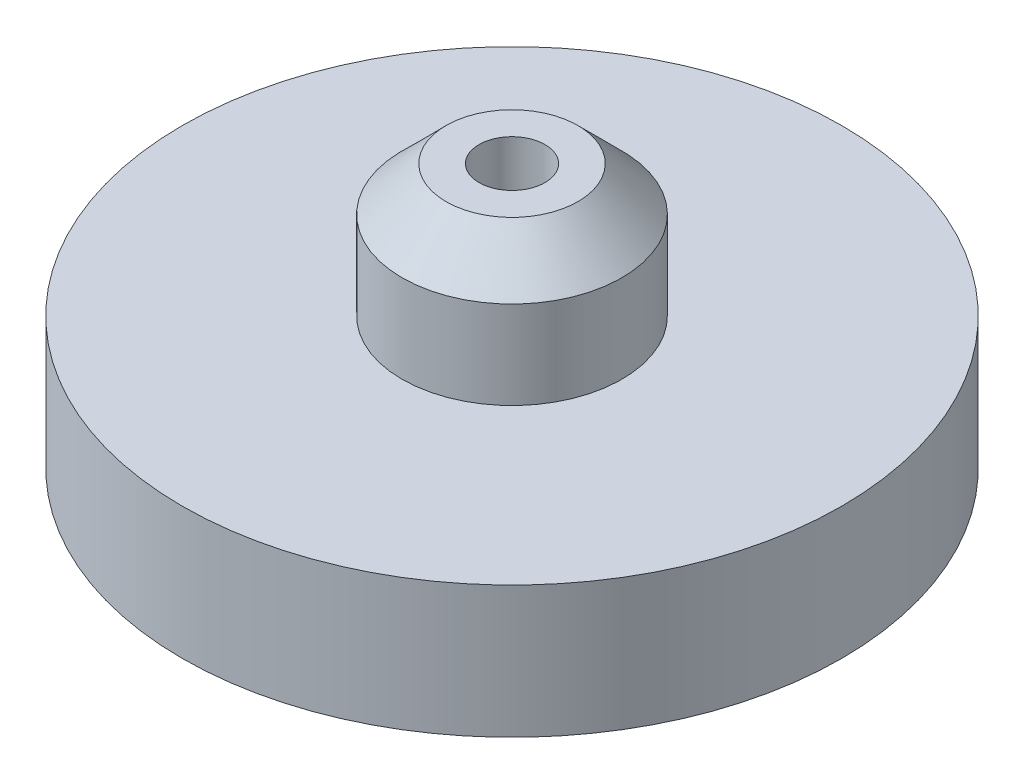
ISO-10303-21;
HEADER;
FILE_DESCRIPTION(('STEP AP214'),'2;1');
FILE_NAME('part.step','',(''),(''),'','','');
FILE_SCHEMA(('AUTOMOTIVE_DESIGN { 1 0 10303 214 1 1 1 1 }'));
ENDSEC;
DATA;
#1=APPLICATION_CONTEXT('core data for automotive mechanical design processes');
#2=APPLICATION_PROTOCOL_DEFINITION('international standard','automotive_design',2000,#1);
#3=PRODUCT_CONTEXT('',#1,'mechanical');
#4=PRODUCT('Part','Part','',(#3));
#5=PRODUCT_RELATED_PRODUCT_CATEGORY('part','',(#4));
#6=PRODUCT_DEFINITION_FORMATION('','',#4);
#7=PRODUCT_DEFINITION_CONTEXT('part definition',#1,'design');
#8=PRODUCT_DEFINITION('design','',#6,#7);
#9=PRODUCT_DEFINITION_SHAPE('','',#8);
#10=(LENGTH_UNIT() NAMED_UNIT(*) SI_UNIT(.MILLI.,.METRE.));
#11=(NAMED_UNIT(*) PLANE_ANGLE_UNIT() SI_UNIT($,.RADIAN.));
#12=(NAMED_UNIT(*) SI_UNIT($,.STERADIAN.) SOLID_ANGLE_UNIT());
#13=UNCERTAINTY_MEASURE_WITH_UNIT(LENGTH_MEASURE(1.E-05),#10,'distance_accuracy_value','');
#14=(GEOMETRIC_REPRESENTATION_CONTEXT(3) GLOBAL_UNCERTAINTY_ASSIGNED_CONTEXT((#13)) GLOBAL_UNIT_ASSIGNED_CONTEXT((#10,
#11,#12)) REPRESENTATION_CONTEXT('',''));
#15=CARTESIAN_POINT('',(0.,0.,0.));
#16=DIRECTION('',(0.,0.,1.));
#17=DIRECTION('',(1.,0.,0.));
#18=AXIS2_PLACEMENT_3D('',#15,#16,#17);
#19=CARTESIAN_POINT('',(0.,6.,0.));
#20=DIRECTION('',(0.,1.,0.));
#21=DIRECTION('',(0.,0.,1.));
#22=AXIS2_PLACEMENT_3D('',#19,#20,#21);
#23=PLANE('',#22);
#24=CARTESIAN_POINT('',(0.,6.,0.));
#25=DIRECTION('',(0.,1.,0.));
#26=DIRECTION('',(0.,0.,1.));
#27=AXIS2_PLACEMENT_3D('',#24,#25,#26);
#28=CIRCLE('',#27,15.);
#29=CARTESIAN_POINT('',(0.,6.,15.));
#30=VERTEX_POINT('',#29);
#31=EDGE_CURVE('E41',#30,#30,#28,.T.);
#32=ORIENTED_EDGE('',*,*,#31,.T.);
#33=EDGE_LOOP('',(#32));
#34=FACE_BOUND('',#33,.T.);
#35=CARTESIAN_POINT('',(0.,6.,0.));
#36=DIRECTION('',(0.,1.,0.));
#37=DIRECTION('',(0.,0.,1.));
#38=AXIS2_PLACEMENT_3D('',#35,#36,#37);
#39=CIRCLE('',#38,5.);
#40=CARTESIAN_POINT('',(0.,6.,5.));
#41=VERTEX_POINT('',#40);
#42=EDGE_CURVE('E50',#41,#41,#39,.T.);
#43=ORIENTED_EDGE('',*,*,#42,.F.);
#44=EDGE_LOOP('',(#43));
#45=FACE_BOUND('',#44,.T.);
#46=ADVANCED_FACE('F30',(#34,#45),#23,.T.);
#47=CARTESIAN_POINT('',(0.,6.,0.));
#48=DIRECTION('',(0.,-1.,0.));
#49=DIRECTION('',(0.,0.,-1.));
#50=AXIS2_PLACEMENT_3D('',#47,#48,#49);
#51=CYLINDRICAL_SURFACE('',#50,15.);
#52=ORIENTED_EDGE('',*,*,#31,.F.);
#53=EDGE_LOOP('',(#52));
#54=FACE_BOUND('',#53,.T.);
#55=CARTESIAN_POINT('',(0.,0.,0.));
#56=DIRECTION('',(0.,1.,0.));
#57=DIRECTION('',(0.,0.,1.));
#58=AXIS2_PLACEMENT_3D('',#55,#56,#57);
#59=CIRCLE('',#58,15.);
#60=CARTESIAN_POINT('',(0.,0.,15.));
#61=VERTEX_POINT('',#60);
#62=EDGE_CURVE('E45',#61,#61,#59,.T.);
#63=ORIENTED_EDGE('',*,*,#62,.T.);
#64=EDGE_LOOP('',(#63));
#65=FACE_BOUND('',#64,.T.);
#66=ADVANCED_FACE('F32',(#54,#65),#51,.T.);
#67=CARTESIAN_POINT('',(0.,0.,0.));
#68=DIRECTION('',(0.,1.,0.));
#69=DIRECTION('',(0.,0.,1.));
#70=AXIS2_PLACEMENT_3D('',#67,#68,#69);
#71=PLANE('',#70);
#72=CARTESIAN_POINT('',(0.,0.,0.));
#73=DIRECTION('',(0.,1.,0.));
#74=DIRECTION('',(0.,0.,1.));
#75=AXIS2_PLACEMENT_3D('',#72,#73,#74);
#76=CIRCLE('',#75,1.5);
#77=CARTESIAN_POINT('',(0.,0.,1.5));
#78=VERTEX_POINT('',#77);
#79=EDGE_CURVE('E53',#78,#78,#76,.T.);
#80=ORIENTED_EDGE('',*,*,#79,.T.);
#81=EDGE_LOOP('',(#80));
#82=FACE_BOUND('',#81,.T.);
#83=ORIENTED_EDGE('',*,*,#62,.F.);
#84=EDGE_LOOP('',(#83));
#85=FACE_BOUND('',#84,.T.);
#86=ADVANCED_FACE('F73',(#82,#85),#71,.F.);
#87=CARTESIAN_POINT('',(0.,12.,0.));
#88=DIRECTION('',(0.,-1.,0.));
#89=DIRECTION('',(0.,0.,-1.));
#90=AXIS2_PLACEMENT_3D('',#87,#88,#89);
#91=CYLINDRICAL_SURFACE('',#90,5.);
#92=CARTESIAN_POINT('',(0.,9.99999999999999,0.));
#93=DIRECTION('',(0.,1.,0.));
#94=DIRECTION('',(0.,0.,1.));
#95=AXIS2_PLACEMENT_3D('',#92,#93,#94);
#96=CIRCLE('',#95,5.);
#97=CARTESIAN_POINT('',(0.,9.99999999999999,5.));
#98=VERTEX_POINT('',#97);
#99=EDGE_CURVE('E10',#98,#98,#96,.F.);
#100=ORIENTED_EDGE('',*,*,#99,.T.);
#101=EDGE_LOOP('',(#100));
#102=FACE_BOUND('',#101,.T.);
#103=ORIENTED_EDGE('',*,*,#42,.T.);
#104=EDGE_LOOP('',(#103));
#105=FACE_BOUND('',#104,.T.);
#106=ADVANCED_FACE('F65',(#102,#105),#91,.T.);
#107=CARTESIAN_POINT('',(0.,12.,0.));
#108=DIRECTION('',(0.,1.,0.));
#109=DIRECTION('',(0.,0.,1.));
#110=AXIS2_PLACEMENT_3D('',#107,#108,#109);
#111=PLANE('',#110);
#112=CARTESIAN_POINT('',(0.,12.,0.));
#113=DIRECTION('',(0.,1.,0.));
#114=DIRECTION('',(0.,0.,1.));
#115=AXIS2_PLACEMENT_3D('',#112,#113,#114);
#116=CIRCLE('',#115,1.5);
#117=CARTESIAN_POINT('',(0.,12.,1.5));
#118=VERTEX_POINT('',#117);
#119=EDGE_CURVE('E56',#118,#118,#116,.T.);
#120=ORIENTED_EDGE('',*,*,#119,.F.);
#121=EDGE_LOOP('',(#120));
#122=FACE_BOUND('',#121,.T.);
#123=CARTESIAN_POINT('',(0.,12.,0.));
#124=DIRECTION('',(0.,1.,0.));
#125=DIRECTION('',(0.,0.,1.));
#126=AXIS2_PLACEMENT_3D('',#123,#124,#125);
#127=CIRCLE('',#126,3.);
#128=CARTESIAN_POINT('',(0.,12.,3.));
#129=VERTEX_POINT('',#128);
#130=EDGE_CURVE('E37',#129,#129,#127,.T.);
#131=ORIENTED_EDGE('',*,*,#130,.T.);
#132=EDGE_LOOP('',(#131));
#133=FACE_BOUND('',#132,.T.);
#134=ADVANCED_FACE('F62',(#122,#133),#111,.T.);
#135=CARTESIAN_POINT('',(0.,12.,0.));
#136=DIRECTION('',(0.,-1.,0.));
#137=DIRECTION('',(0.,0.,-1.));
#138=AXIS2_PLACEMENT_3D('',#135,#136,#137);
#139=CONICAL_SURFACE('',#138,3.,0.785398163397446);
#140=ORIENTED_EDGE('',*,*,#99,.F.);
#141=EDGE_LOOP('',(#140));
#142=FACE_BOUND('',#141,.T.);
#143=ORIENTED_EDGE('',*,*,#130,.F.);
#144=EDGE_LOOP('',(#143));
#145=FACE_BOUND('',#144,.T.);
#146=ADVANCED_FACE('F64',(#142,#145),#139,.T.);
#147=CARTESIAN_POINT('',(0.,0.,0.));
#148=DIRECTION('',(0.,1.,0.));
#149=DIRECTION('',(0.,0.,1.));
#150=AXIS2_PLACEMENT_3D('',#147,#148,#149);
#151=CYLINDRICAL_SURFACE('',#150,1.5);
#152=ORIENTED_EDGE('',*,*,#79,.F.);
#153=EDGE_LOOP('',(#152));
#154=FACE_BOUND('',#153,.T.);
#155=ORIENTED_EDGE('',*,*,#119,.T.);
#156=EDGE_LOOP('',(#155));
#157=FACE_BOUND('',#156,.T.);
#158=ADVANCED_FACE('F60',(#154,#157),#151,.F.);
#159=CLOSED_SHELL('',(#46,#66,#86,#106,#134,#146,#158));
#160=MANIFOLD_SOLID_BREP('B2',#159);
#161=ADVANCED_BREP_SHAPE_REPRESENTATION('',(#18,#160),#14);
#162=SHAPE_DEFINITION_REPRESENTATION(#9,#161);
ENDSEC;
END-ISO-10303-21;
